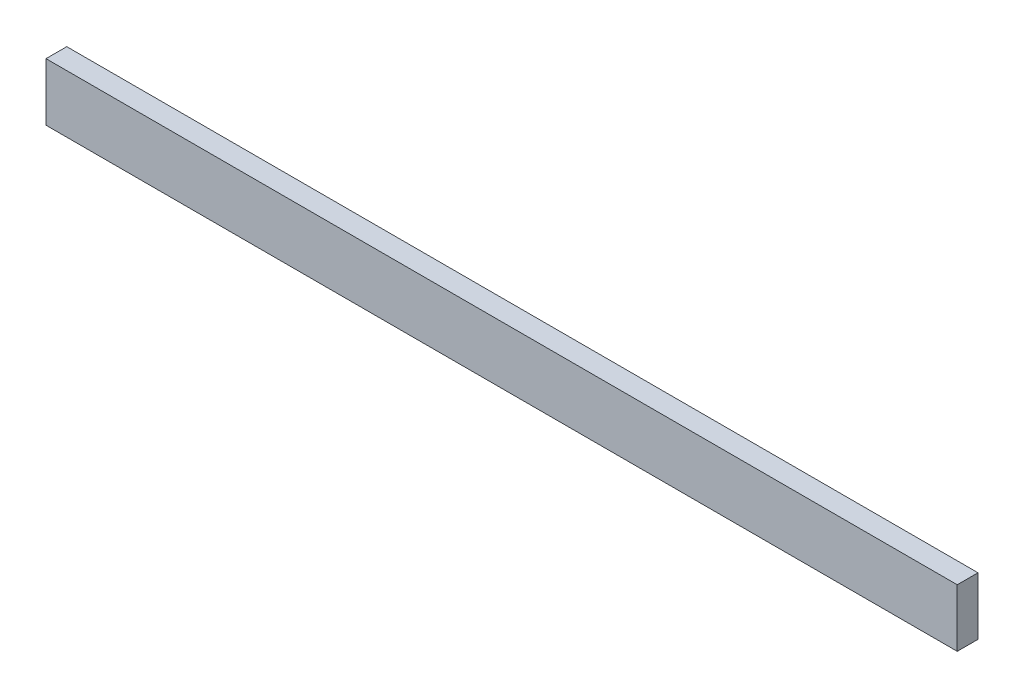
ISO-10303-21;
HEADER;
FILE_DESCRIPTION(('STEP AP214'),'2;1');
FILE_NAME('part.step','',(''),(''),'','','');
FILE_SCHEMA(('AUTOMOTIVE_DESIGN { 1 0 10303 214 1 1 1 1 }'));
ENDSEC;
DATA;
#1=APPLICATION_CONTEXT('core data for automotive mechanical design processes');
#2=APPLICATION_PROTOCOL_DEFINITION('international standard','automotive_design',2000,#1);
#3=PRODUCT_CONTEXT('',#1,'mechanical');
#4=PRODUCT('Part','Part','',(#3));
#5=PRODUCT_RELATED_PRODUCT_CATEGORY('part','',(#4));
#6=PRODUCT_DEFINITION_FORMATION('','',#4);
#7=PRODUCT_DEFINITION_CONTEXT('part definition',#1,'design');
#8=PRODUCT_DEFINITION('design','',#6,#7);
#9=PRODUCT_DEFINITION_SHAPE('','',#8);
#10=(LENGTH_UNIT() NAMED_UNIT(*) SI_UNIT(.MILLI.,.METRE.));
#11=(NAMED_UNIT(*) PLANE_ANGLE_UNIT() SI_UNIT($,.RADIAN.));
#12=(NAMED_UNIT(*) SI_UNIT($,.STERADIAN.) SOLID_ANGLE_UNIT());
#13=UNCERTAINTY_MEASURE_WITH_UNIT(LENGTH_MEASURE(1.E-05),#10,'distance_accuracy_value','');
#14=(GEOMETRIC_REPRESENTATION_CONTEXT(3) GLOBAL_UNCERTAINTY_ASSIGNED_CONTEXT((#13)) GLOBAL_UNIT_ASSIGNED_CONTEXT((#10,
#11,#12)) REPRESENTATION_CONTEXT('',''));
#15=CARTESIAN_POINT('',(0.,0.,0.));
#16=DIRECTION('',(0.,0.,1.));
#17=DIRECTION('',(1.,0.,0.));
#18=AXIS2_PLACEMENT_3D('',#15,#16,#17);
#19=CARTESIAN_POINT('',(9.00000000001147,-949.999999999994,-18.));
#20=DIRECTION('',(-1.,0.,0.));
#21=DIRECTION('',(0.,0.,1.));
#22=AXIS2_PLACEMENT_3D('',#19,#20,#21);
#23=PLANE('',#22);
#24=DIRECTION('',(0.,-1.,0.));
#25=VECTOR('',#24,1.);
#26=CARTESIAN_POINT('',(9.00000000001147,-949.999999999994,0.));
#27=LINE('',#26,#25);
#28=CARTESIAN_POINT('',(9.00000000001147,-949.999999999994,0.));
#29=VERTEX_POINT('',#28);
#30=CARTESIAN_POINT('',(9.00000000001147,-1000.,0.));
#31=VERTEX_POINT('',#30);
#32=EDGE_CURVE('E97',#29,#31,#27,.T.);
#33=ORIENTED_EDGE('',*,*,#32,.F.);
#34=DIRECTION('',(0.,0.,1.));
#35=VECTOR('',#34,1.);
#36=CARTESIAN_POINT('',(9.00000000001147,-949.999999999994,-18.));
#37=LINE('',#36,#35);
#38=CARTESIAN_POINT('',(9.00000000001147,-949.999999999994,-18.));
#39=VERTEX_POINT('',#38);
#40=EDGE_CURVE('E11',#39,#29,#37,.T.);
#41=ORIENTED_EDGE('',*,*,#40,.F.);
#42=DIRECTION('',(0.,-1.,0.));
#43=VECTOR('',#42,1.);
#44=CARTESIAN_POINT('',(9.00000000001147,-949.999999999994,-18.));
#45=LINE('',#44,#43);
#46=CARTESIAN_POINT('',(9.00000000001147,-1000.,-18.));
#47=VERTEX_POINT('',#46);
#48=EDGE_CURVE('E91',#39,#47,#45,.T.);
#49=ORIENTED_EDGE('',*,*,#48,.T.);
#50=DIRECTION('',(0.,0.,1.));
#51=VECTOR('',#50,1.);
#52=CARTESIAN_POINT('',(9.00000000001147,-1000.,-18.));
#53=LINE('',#52,#51);
#54=EDGE_CURVE('E36',#47,#31,#53,.T.);
#55=ORIENTED_EDGE('',*,*,#54,.T.);
#56=EDGE_LOOP('',(#33,#41,#49,#55));
#57=FACE_BOUND('',#56,.T.);
#58=ADVANCED_FACE('F33',(#57),#23,.T.);
#59=CARTESIAN_POINT('',(9.00000000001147,-949.999999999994,-18.));
#60=DIRECTION('',(0.,1.,0.));
#61=DIRECTION('',(0.,0.,1.));
#62=AXIS2_PLACEMENT_3D('',#59,#60,#61);
#63=PLANE('',#62);
#64=DIRECTION('',(-1.,0.,0.));
#65=VECTOR('',#64,1.);
#66=CARTESIAN_POINT('',(9.00000000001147,-949.999999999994,0.));
#67=LINE('',#66,#65);
#68=CARTESIAN_POINT('',(799.000000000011,-949.999999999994,0.));
#69=VERTEX_POINT('',#68);
#70=EDGE_CURVE('E93',#69,#29,#67,.T.);
#71=ORIENTED_EDGE('',*,*,#70,.F.);
#72=DIRECTION('',(0.,0.,1.));
#73=VECTOR('',#72,1.);
#74=CARTESIAN_POINT('',(799.000000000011,-949.999999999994,-18.));
#75=LINE('',#74,#73);
#76=CARTESIAN_POINT('',(799.000000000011,-949.999999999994,-18.));
#77=VERTEX_POINT('',#76);
#78=EDGE_CURVE('E42',#77,#69,#75,.T.);
#79=ORIENTED_EDGE('',*,*,#78,.F.);
#80=DIRECTION('',(-1.,0.,0.));
#81=VECTOR('',#80,1.);
#82=CARTESIAN_POINT('',(9.00000000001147,-949.999999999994,-18.));
#83=LINE('',#82,#81);
#84=EDGE_CURVE('E88',#77,#39,#83,.T.);
#85=ORIENTED_EDGE('',*,*,#84,.T.);
#86=ORIENTED_EDGE('',*,*,#40,.T.);
#87=EDGE_LOOP('',(#71,#79,#85,#86));
#88=FACE_BOUND('',#87,.T.);
#89=ADVANCED_FACE('F107',(#88),#63,.T.);
#90=CARTESIAN_POINT('',(799.000000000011,-949.999999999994,-18.));
#91=DIRECTION('',(1.,0.,0.));
#92=DIRECTION('',(0.,0.,-1.));
#93=AXIS2_PLACEMENT_3D('',#90,#91,#92);
#94=PLANE('',#93);
#95=DIRECTION('',(0.,1.,0.));
#96=VECTOR('',#95,1.);
#97=CARTESIAN_POINT('',(799.000000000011,-949.999999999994,0.));
#98=LINE('',#97,#96);
#99=CARTESIAN_POINT('',(799.000000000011,-1000.,0.));
#100=VERTEX_POINT('',#99);
#101=EDGE_CURVE('E83',#100,#69,#98,.T.);
#102=ORIENTED_EDGE('',*,*,#101,.F.);
#103=DIRECTION('',(0.,0.,1.));
#104=VECTOR('',#103,1.);
#105=CARTESIAN_POINT('',(799.000000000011,-1000.,-18.));
#106=LINE('',#105,#104);
#107=CARTESIAN_POINT('',(799.000000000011,-1000.,-18.));
#108=VERTEX_POINT('',#107);
#109=EDGE_CURVE('E78',#108,#100,#106,.T.);
#110=ORIENTED_EDGE('',*,*,#109,.F.);
#111=DIRECTION('',(0.,1.,0.));
#112=VECTOR('',#111,1.);
#113=CARTESIAN_POINT('',(799.000000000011,-949.999999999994,-18.));
#114=LINE('',#113,#112);
#115=EDGE_CURVE('E81',#108,#77,#114,.T.);
#116=ORIENTED_EDGE('',*,*,#115,.T.);
#117=ORIENTED_EDGE('',*,*,#78,.T.);
#118=EDGE_LOOP('',(#102,#110,#116,#117));
#119=FACE_BOUND('',#118,.T.);
#120=ADVANCED_FACE('F80',(#119),#94,.T.);
#121=CARTESIAN_POINT('',(9.00000000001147,-1000.,-18.));
#122=DIRECTION('',(0.,-1.,0.));
#123=DIRECTION('',(0.,0.,-1.));
#124=AXIS2_PLACEMENT_3D('',#121,#122,#123);
#125=PLANE('',#124);
#126=DIRECTION('',(1.,0.,0.));
#127=VECTOR('',#126,1.);
#128=CARTESIAN_POINT('',(9.00000000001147,-1000.,0.));
#129=LINE('',#128,#127);
#130=EDGE_CURVE('E100',#31,#100,#129,.T.);
#131=ORIENTED_EDGE('',*,*,#130,.F.);
#132=ORIENTED_EDGE('',*,*,#54,.F.);
#133=DIRECTION('',(1.,0.,0.));
#134=VECTOR('',#133,1.);
#135=CARTESIAN_POINT('',(9.00000000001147,-1000.,-18.));
#136=LINE('',#135,#134);
#137=EDGE_CURVE('E87',#47,#108,#136,.T.);
#138=ORIENTED_EDGE('',*,*,#137,.T.);
#139=ORIENTED_EDGE('',*,*,#109,.T.);
#140=EDGE_LOOP('',(#131,#132,#138,#139));
#141=FACE_BOUND('',#140,.T.);
#142=ADVANCED_FACE('F90',(#141),#125,.T.);
#143=CARTESIAN_POINT('',(0.,0.,-18.));
#144=DIRECTION('',(0.,0.,1.));
#145=DIRECTION('',(1.,0.,0.));
#146=AXIS2_PLACEMENT_3D('',#143,#144,#145);
#147=PLANE('',#146);
#148=ORIENTED_EDGE('',*,*,#48,.F.);
#149=ORIENTED_EDGE('',*,*,#84,.F.);
#150=ORIENTED_EDGE('',*,*,#115,.F.);
#151=ORIENTED_EDGE('',*,*,#137,.F.);
#152=EDGE_LOOP('',(#148,#149,#150,#151));
#153=FACE_BOUND('',#152,.T.);
#154=ADVANCED_FACE('F86',(#153),#147,.F.);
#155=CARTESIAN_POINT('',(0.,0.,0.));
#156=DIRECTION('',(0.,0.,1.));
#157=DIRECTION('',(1.,0.,0.));
#158=AXIS2_PLACEMENT_3D('',#155,#156,#157);
#159=PLANE('',#158);
#160=ORIENTED_EDGE('',*,*,#32,.T.);
#161=ORIENTED_EDGE('',*,*,#130,.T.);
#162=ORIENTED_EDGE('',*,*,#101,.T.);
#163=ORIENTED_EDGE('',*,*,#70,.T.);
#164=EDGE_LOOP('',(#160,#161,#162,#163));
#165=FACE_BOUND('',#164,.T.);
#166=ADVANCED_FACE('F106',(#165),#159,.T.);
#167=CLOSED_SHELL('',(#58,#89,#120,#142,#154,#166));
#168=MANIFOLD_SOLID_BREP('B2',#167);
#169=ADVANCED_BREP_SHAPE_REPRESENTATION('',(#18,#168),#14);
#170=SHAPE_DEFINITION_REPRESENTATION(#9,#169);
ENDSEC;
END-ISO-10303-21;
